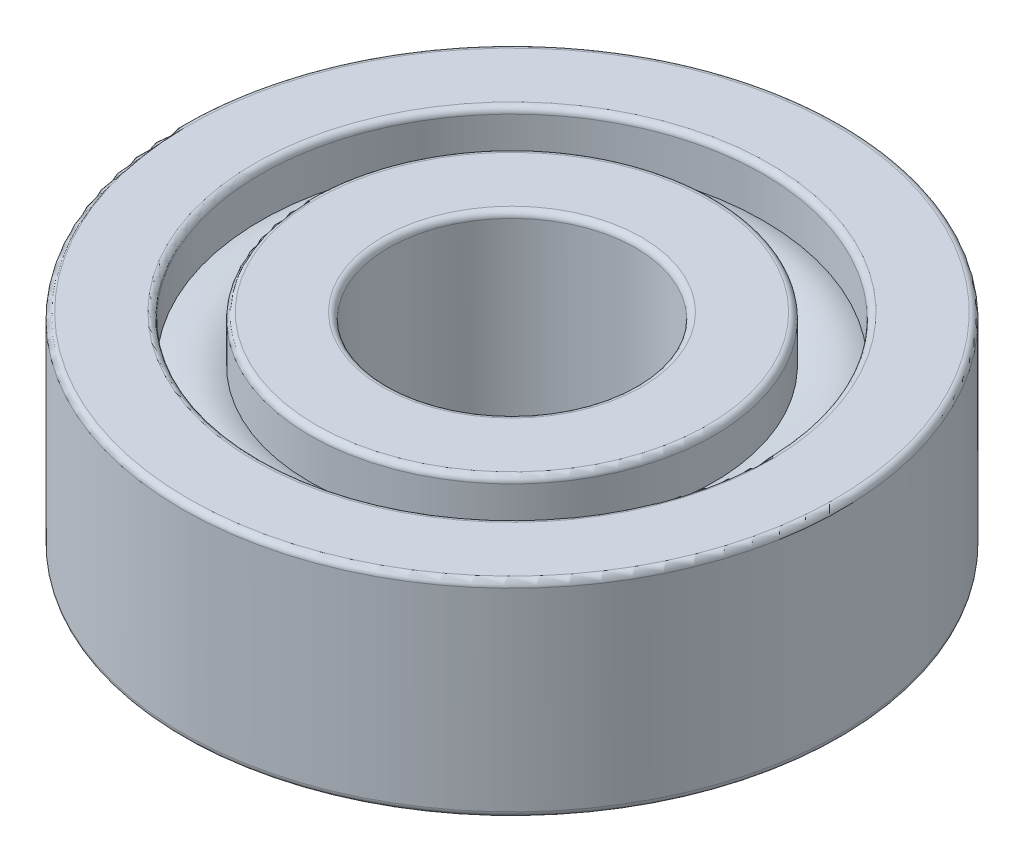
ISO-10303-21;
HEADER;
FILE_DESCRIPTION(('STEP AP214'),'2;1');
FILE_NAME('part.step','',(''),(''),'','','');
FILE_SCHEMA(('AUTOMOTIVE_DESIGN { 1 0 10303 214 1 1 1 1 }'));
ENDSEC;
DATA;
#1=APPLICATION_CONTEXT('core data for automotive mechanical design processes');
#2=APPLICATION_PROTOCOL_DEFINITION('international standard','automotive_design',2000,#1);
#3=PRODUCT_CONTEXT('',#1,'mechanical');
#4=PRODUCT('Part','Part','',(#3));
#5=PRODUCT_RELATED_PRODUCT_CATEGORY('part','',(#4));
#6=PRODUCT_DEFINITION_FORMATION('','',#4);
#7=PRODUCT_DEFINITION_CONTEXT('part definition',#1,'design');
#8=PRODUCT_DEFINITION('design','',#6,#7);
#9=PRODUCT_DEFINITION_SHAPE('','',#8);
#10=(LENGTH_UNIT() NAMED_UNIT(*) SI_UNIT(.MILLI.,.METRE.));
#11=(NAMED_UNIT(*) PLANE_ANGLE_UNIT() SI_UNIT($,.RADIAN.));
#12=(NAMED_UNIT(*) SI_UNIT($,.STERADIAN.) SOLID_ANGLE_UNIT());
#13=UNCERTAINTY_MEASURE_WITH_UNIT(LENGTH_MEASURE(1.E-05),#10,'distance_accuracy_value','');
#14=(GEOMETRIC_REPRESENTATION_CONTEXT(3) GLOBAL_UNCERTAINTY_ASSIGNED_CONTEXT((#13)) GLOBAL_UNIT_ASSIGNED_CONTEXT((#10,
#11,#12)) REPRESENTATION_CONTEXT('',''));
#15=CARTESIAN_POINT('',(0.,0.,0.));
#16=DIRECTION('',(0.,0.,1.));
#17=DIRECTION('',(1.,0.,0.));
#18=AXIS2_PLACEMENT_3D('',#15,#16,#17);
#19=CARTESIAN_POINT('',(1.38777878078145E-13,0.,1.38777878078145E-13));
#20=DIRECTION('',(0.,-1.,0.));
#21=DIRECTION('',(0.,0.,-1.));
#22=AXIS2_PLACEMENT_3D('',#19,#20,#21);
#23=CYLINDRICAL_SURFACE('',#22,6.);
#24=CARTESIAN_POINT('',(0.,0.300000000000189,1.2490009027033E-13));
#25=DIRECTION('',(0.,-1.,0.));
#26=DIRECTION('',(0.,0.,-1.));
#27=AXIS2_PLACEMENT_3D('',#24,#25,#26);
#28=CIRCLE('',#27,6.);
#29=CARTESIAN_POINT('',(0.,0.300000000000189,-5.99999999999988));
#30=VERTEX_POINT('',#29);
#31=EDGE_CURVE('E91',#30,#30,#28,.T.);
#32=ORIENTED_EDGE('',*,*,#31,.T.);
#33=EDGE_LOOP('',(#32));
#34=FACE_BOUND('',#33,.T.);
#35=CARTESIAN_POINT('',(1.38777878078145E-13,9.70000000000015,-5.41233724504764E-13));
#36=DIRECTION('',(0.,1.,0.));
#37=DIRECTION('',(0.,0.,1.));
#38=AXIS2_PLACEMENT_3D('',#35,#36,#37);
#39=CIRCLE('',#38,6.);
#40=CARTESIAN_POINT('',(1.65256697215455E-13,9.70000000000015,5.99999999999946));
#41=VERTEX_POINT('',#40);
#42=EDGE_CURVE('E94',#41,#41,#39,.T.);
#43=ORIENTED_EDGE('',*,*,#42,.T.);
#44=EDGE_LOOP('',(#43));
#45=FACE_BOUND('',#44,.T.);
#46=ADVANCED_FACE('F42',(#34,#45),#23,.F.);
#47=CARTESIAN_POINT('',(6.00000000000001,0.,0.));
#48=DIRECTION('',(0.,-1.,0.));
#49=DIRECTION('',(0.,0.,-1.));
#50=AXIS2_PLACEMENT_3D('',#47,#48,#49);
#51=PLANE('',#50);
#52=CARTESIAN_POINT('',(1.38777878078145E-13,0.,1.38777878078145E-13));
#53=DIRECTION('',(0.,-1.,0.));
#54=DIRECTION('',(0.,0.,-1.));
#55=AXIS2_PLACEMENT_3D('',#52,#53,#54);
#56=CIRCLE('',#55,6.3);
#57=CARTESIAN_POINT('',(1.10975117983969E-13,0.,-6.29999999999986));
#58=VERTEX_POINT('',#57);
#59=EDGE_CURVE('E85',#58,#58,#56,.F.);
#60=ORIENTED_EDGE('',*,*,#59,.T.);
#61=EDGE_LOOP('',(#60));
#62=FACE_BOUND('',#61,.T.);
#63=CARTESIAN_POINT('',(1.38777878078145E-13,0.,1.38777878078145E-13));
#64=DIRECTION('',(0.,-1.,0.));
#65=DIRECTION('',(0.,0.,-1.));
#66=AXIS2_PLACEMENT_3D('',#63,#64,#65);
#67=CIRCLE('',#66,9.5);
#68=CARTESIAN_POINT('',(0.,0.,-9.49999999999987));
#69=VERTEX_POINT('',#68);
#70=EDGE_CURVE('E88',#69,#69,#67,.T.);
#71=ORIENTED_EDGE('',*,*,#70,.T.);
#72=EDGE_LOOP('',(#71));
#73=FACE_BOUND('',#72,.T.);
#74=ADVANCED_FACE('F128',(#62,#73),#51,.T.);
#75=CARTESIAN_POINT('',(1.38777878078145E-13,0.,1.38777878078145E-13));
#76=DIRECTION('',(0.,-1.,0.));
#77=DIRECTION('',(0.,0.,-1.));
#78=AXIS2_PLACEMENT_3D('',#75,#76,#77);
#79=CYLINDRICAL_SURFACE('',#78,9.8);
#80=CARTESIAN_POINT('',(0.,0.300000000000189,1.2490009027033E-13));
#81=DIRECTION('',(0.,-1.,0.));
#82=DIRECTION('',(0.,0.,-1.));
#83=AXIS2_PLACEMENT_3D('',#80,#81,#82);
#84=CIRCLE('',#83,9.8);
#85=CARTESIAN_POINT('',(0.,0.30000000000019,-9.79999999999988));
#86=VERTEX_POINT('',#85);
#87=EDGE_CURVE('E82',#86,#86,#84,.F.);
#88=ORIENTED_EDGE('',*,*,#87,.T.);
#89=EDGE_LOOP('',(#88));
#90=FACE_BOUND('',#89,.T.);
#91=CARTESIAN_POINT('',(1.11022302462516E-13,2.25045458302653,1.66533453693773E-13));
#92=DIRECTION('',(0.,-1.,0.));
#93=DIRECTION('',(0.,0.,-1.));
#94=AXIS2_PLACEMENT_3D('',#91,#92,#93);
#95=CIRCLE('',#94,9.8);
#96=CARTESIAN_POINT('',(0.,2.25045458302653,-9.79999999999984));
#97=VERTEX_POINT('',#96);
#98=EDGE_CURVE('E97',#97,#97,#95,.T.);
#99=ORIENTED_EDGE('',*,*,#98,.T.);
#100=EDGE_LOOP('',(#99));
#101=FACE_BOUND('',#100,.T.);
#102=ADVANCED_FACE('F133',(#90,#101),#79,.T.);
#103=CARTESIAN_POINT('',(0.,5.00000000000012,0.));
#104=DIRECTION('',(0.,-1.,0.));
#105=DIRECTION('',(0.,0.,-1.));
#106=AXIS2_PLACEMENT_3D('',#103,#104,#105);
#107=TOROIDAL_SURFACE('',#106,11.,3.);
#108=CARTESIAN_POINT('',(1.11022302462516E-13,2.25045458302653,1.66533453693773E-13));
#109=DIRECTION('',(0.,-1.,0.));
#110=DIRECTION('',(0.,0.,-1.));
#111=AXIS2_PLACEMENT_3D('',#108,#109,#110);
#112=CIRCLE('',#111,12.2);
#113=CARTESIAN_POINT('',(0.,2.25045458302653,-12.1999999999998));
#114=VERTEX_POINT('',#113);
#115=EDGE_CURVE('E100',#114,#114,#112,.T.);
#116=ORIENTED_EDGE('',*,*,#115,.T.);
#117=EDGE_LOOP('',(#116));
#118=FACE_BOUND('',#117,.T.);
#119=ORIENTED_EDGE('',*,*,#98,.F.);
#120=EDGE_LOOP('',(#119));
#121=FACE_BOUND('',#120,.T.);
#122=ADVANCED_FACE('F241',(#118,#121),#107,.T.);
#123=CARTESIAN_POINT('',(1.38777878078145E-13,0.,1.38777878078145E-13));
#124=DIRECTION('',(0.,-1.,0.));
#125=DIRECTION('',(0.,0.,-1.));
#126=AXIS2_PLACEMENT_3D('',#123,#124,#125);
#127=CYLINDRICAL_SURFACE('',#126,12.2);
#128=CARTESIAN_POINT('',(0.,0.300000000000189,1.2490009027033E-13));
#129=DIRECTION('',(0.,-1.,0.));
#130=DIRECTION('',(0.,0.,-1.));
#131=AXIS2_PLACEMENT_3D('',#128,#129,#130);
#132=CIRCLE('',#131,12.2);
#133=CARTESIAN_POINT('',(0.,0.30000000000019,-12.1999999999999));
#134=VERTEX_POINT('',#133);
#135=EDGE_CURVE('E79',#134,#134,#132,.T.);
#136=ORIENTED_EDGE('',*,*,#135,.T.);
#137=EDGE_LOOP('',(#136));
#138=FACE_BOUND('',#137,.T.);
#139=ORIENTED_EDGE('',*,*,#115,.F.);
#140=EDGE_LOOP('',(#139));
#141=FACE_BOUND('',#140,.T.);
#142=ADVANCED_FACE('F237',(#138,#141),#127,.F.);
#143=CARTESIAN_POINT('',(12.2000000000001,4.44089209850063E-13,0.));
#144=DIRECTION('',(0.,-1.,0.));
#145=DIRECTION('',(0.,0.,-1.));
#146=AXIS2_PLACEMENT_3D('',#143,#144,#145);
#147=PLANE('',#146);
#148=CARTESIAN_POINT('',(1.38777878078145E-13,0.,1.38777878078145E-13));
#149=DIRECTION('',(0.,-1.,0.));
#150=DIRECTION('',(0.,0.,-1.));
#151=AXIS2_PLACEMENT_3D('',#148,#149,#150);
#152=CIRCLE('',#151,12.5);
#153=CARTESIAN_POINT('',(0.,0.,-12.4999999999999));
#154=VERTEX_POINT('',#153);
#155=EDGE_CURVE('E73',#154,#154,#152,.F.);
#156=ORIENTED_EDGE('',*,*,#155,.T.);
#157=EDGE_LOOP('',(#156));
#158=FACE_BOUND('',#157,.T.);
#159=CARTESIAN_POINT('',(1.38777878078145E-13,0.,1.38777878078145E-13));
#160=DIRECTION('',(0.,-1.,0.));
#161=DIRECTION('',(0.,0.,-1.));
#162=AXIS2_PLACEMENT_3D('',#159,#160,#161);
#163=CIRCLE('',#162,15.7);
#164=CARTESIAN_POINT('',(0.,0.,-15.6999999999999));
#165=VERTEX_POINT('',#164);
#166=EDGE_CURVE('E76',#165,#165,#163,.T.);
#167=ORIENTED_EDGE('',*,*,#166,.T.);
#168=EDGE_LOOP('',(#167));
#169=FACE_BOUND('',#168,.T.);
#170=ADVANCED_FACE('F231',(#158,#169),#147,.T.);
#171=CARTESIAN_POINT('',(1.38777878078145E-13,0.,1.38777878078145E-13));
#172=DIRECTION('',(0.,-1.,0.));
#173=DIRECTION('',(0.,0.,-1.));
#174=AXIS2_PLACEMENT_3D('',#171,#172,#173);
#175=CYLINDRICAL_SURFACE('',#174,16.);
#176=CARTESIAN_POINT('',(0.,0.300000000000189,1.2490009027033E-13));
#177=DIRECTION('',(0.,-1.,0.));
#178=DIRECTION('',(0.,0.,-1.));
#179=AXIS2_PLACEMENT_3D('',#176,#177,#178);
#180=CIRCLE('',#179,16.);
#181=CARTESIAN_POINT('',(0.,0.30000000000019,-15.9999999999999));
#182=VERTEX_POINT('',#181);
#183=EDGE_CURVE('E67',#182,#182,#180,.F.);
#184=ORIENTED_EDGE('',*,*,#183,.T.);
#185=EDGE_LOOP('',(#184));
#186=FACE_BOUND('',#185,.T.);
#187=CARTESIAN_POINT('',(1.38777878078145E-13,9.70000000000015,-5.41233724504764E-13));
#188=DIRECTION('',(0.,1.,0.));
#189=DIRECTION('',(0.,0.,1.));
#190=AXIS2_PLACEMENT_3D('',#187,#188,#189);
#191=CIRCLE('',#190,16.);
#192=CARTESIAN_POINT('',(2.09388062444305E-13,9.70000000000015,15.9999999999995));
#193=VERTEX_POINT('',#192);
#194=EDGE_CURVE('E70',#193,#193,#191,.F.);
#195=ORIENTED_EDGE('',*,*,#194,.T.);
#196=EDGE_LOOP('',(#195));
#197=FACE_BOUND('',#196,.T.);
#198=ADVANCED_FACE('F224',(#186,#197),#175,.T.);
#199=CARTESIAN_POINT('',(16.0000000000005,10.,-3.19189119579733E-13));
#200=DIRECTION('',(0.,1.,0.));
#201=DIRECTION('',(0.,0.,1.));
#202=AXIS2_PLACEMENT_3D('',#199,#200,#201);
#203=PLANE('',#202);
#204=CARTESIAN_POINT('',(0.,10.,-5.55111512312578E-13));
#205=DIRECTION('',(0.,1.,0.));
#206=DIRECTION('',(0.,0.,1.));
#207=AXIS2_PLACEMENT_3D('',#204,#205,#206);
#208=CIRCLE('',#207,15.7);
#209=CARTESIAN_POINT('',(1.52552970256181E-13,10.,15.6999999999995));
#210=VERTEX_POINT('',#209);
#211=EDGE_CURVE('E48',#210,#210,#208,.T.);
#212=ORIENTED_EDGE('',*,*,#211,.T.);
#213=EDGE_LOOP('',(#212));
#214=FACE_BOUND('',#213,.T.);
#215=CARTESIAN_POINT('',(0.,10.,-5.55111512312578E-13));
#216=DIRECTION('',(0.,1.,0.));
#217=DIRECTION('',(0.,0.,1.));
#218=AXIS2_PLACEMENT_3D('',#215,#216,#217);
#219=CIRCLE('',#218,12.5);
#220=CARTESIAN_POINT('',(1.38430933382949E-13,10.,12.4999999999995));
#221=VERTEX_POINT('',#220);
#222=EDGE_CURVE('E52',#221,#221,#219,.F.);
#223=ORIENTED_EDGE('',*,*,#222,.T.);
#224=EDGE_LOOP('',(#223));
#225=FACE_BOUND('',#224,.T.);
#226=ADVANCED_FACE('F222',(#214,#225),#203,.T.);
#227=CARTESIAN_POINT('',(1.38777878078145E-13,0.,1.38777878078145E-13));
#228=DIRECTION('',(0.,-1.,0.));
#229=DIRECTION('',(0.,0.,-1.));
#230=AXIS2_PLACEMENT_3D('',#227,#228,#229);
#231=CYLINDRICAL_SURFACE('',#230,12.2);
#232=CARTESIAN_POINT('',(1.38777878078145E-13,9.70000000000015,-5.41233724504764E-13));
#233=DIRECTION('',(0.,1.,0.));
#234=DIRECTION('',(0.,0.,1.));
#235=AXIS2_PLACEMENT_3D('',#232,#233,#234);
#236=CIRCLE('',#235,12.2);
#237=CARTESIAN_POINT('',(1.92618143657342E-13,9.70000000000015,12.1999999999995));
#238=VERTEX_POINT('',#237);
#239=EDGE_CURVE('E10',#238,#238,#236,.T.);
#240=ORIENTED_EDGE('',*,*,#239,.T.);
#241=EDGE_LOOP('',(#240));
#242=FACE_BOUND('',#241,.T.);
#243=CARTESIAN_POINT('',(-1.11022302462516E-13,7.74954541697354,0.));
#244=DIRECTION('',(0.,-1.,0.));
#245=DIRECTION('',(0.,0.,-1.));
#246=AXIS2_PLACEMENT_3D('',#243,#244,#245);
#247=CIRCLE('',#246,12.2);
#248=CARTESIAN_POINT('',(-1.64862568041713E-13,7.74954541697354,-12.2));
#249=VERTEX_POINT('',#248);
#250=EDGE_CURVE('E103',#249,#249,#247,.T.);
#251=ORIENTED_EDGE('',*,*,#250,.T.);
#252=EDGE_LOOP('',(#251));
#253=FACE_BOUND('',#252,.T.);
#254=ADVANCED_FACE('F125',(#242,#253),#231,.F.);
#255=CARTESIAN_POINT('',(0.,5.00000000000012,0.));
#256=DIRECTION('',(0.,-1.,0.));
#257=DIRECTION('',(0.,0.,-1.));
#258=AXIS2_PLACEMENT_3D('',#255,#256,#257);
#259=TOROIDAL_SURFACE('',#258,11.,3.);
#260=CARTESIAN_POINT('',(-1.11022302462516E-13,7.74954541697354,0.));
#261=DIRECTION('',(0.,-1.,0.));
#262=DIRECTION('',(0.,0.,-1.));
#263=AXIS2_PLACEMENT_3D('',#260,#261,#262);
#264=CIRCLE('',#263,9.8);
#265=CARTESIAN_POINT('',(-1.54271040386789E-13,7.74954541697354,-9.8));
#266=VERTEX_POINT('',#265);
#267=EDGE_CURVE('E106',#266,#266,#264,.T.);
#268=ORIENTED_EDGE('',*,*,#267,.T.);
#269=EDGE_LOOP('',(#268));
#270=FACE_BOUND('',#269,.T.);
#271=ORIENTED_EDGE('',*,*,#250,.F.);
#272=EDGE_LOOP('',(#271));
#273=FACE_BOUND('',#272,.T.);
#274=ADVANCED_FACE('F110',(#270,#273),#259,.T.);
#275=CARTESIAN_POINT('',(1.38777878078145E-13,0.,1.38777878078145E-13));
#276=DIRECTION('',(0.,-1.,0.));
#277=DIRECTION('',(0.,0.,-1.));
#278=AXIS2_PLACEMENT_3D('',#275,#276,#277);
#279=CYLINDRICAL_SURFACE('',#278,9.8);
#280=CARTESIAN_POINT('',(1.38777878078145E-13,9.70000000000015,-5.41233724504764E-13));
#281=DIRECTION('',(0.,1.,0.));
#282=DIRECTION('',(0.,0.,1.));
#283=AXIS2_PLACEMENT_3D('',#280,#281,#282);
#284=CIRCLE('',#283,9.8);
#285=CARTESIAN_POINT('',(1.82026616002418E-13,9.70000000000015,9.79999999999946));
#286=VERTEX_POINT('',#285);
#287=EDGE_CURVE('E64',#286,#286,#284,.F.);
#288=ORIENTED_EDGE('',*,*,#287,.T.);
#289=EDGE_LOOP('',(#288));
#290=FACE_BOUND('',#289,.T.);
#291=ORIENTED_EDGE('',*,*,#267,.F.);
#292=EDGE_LOOP('',(#291));
#293=FACE_BOUND('',#292,.T.);
#294=ADVANCED_FACE('F113',(#290,#293),#279,.T.);
#295=CARTESIAN_POINT('',(9.80000000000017,10.,0.));
#296=DIRECTION('',(0.,1.,0.));
#297=DIRECTION('',(0.,0.,1.));
#298=AXIS2_PLACEMENT_3D('',#295,#296,#297);
#299=PLANE('',#298);
#300=CARTESIAN_POINT('',(0.,10.,-5.55111512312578E-13));
#301=DIRECTION('',(0.,1.,0.));
#302=DIRECTION('',(0.,0.,1.));
#303=AXIS2_PLACEMENT_3D('',#300,#301,#302);
#304=CIRCLE('',#303,9.5);
#305=CARTESIAN_POINT('',(1.25191523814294E-13,10.,9.49999999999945));
#306=VERTEX_POINT('',#305);
#307=EDGE_CURVE('E56',#306,#306,#304,.T.);
#308=ORIENTED_EDGE('',*,*,#307,.T.);
#309=EDGE_LOOP('',(#308));
#310=FACE_BOUND('',#309,.T.);
#311=CARTESIAN_POINT('',(0.,10.,-5.55111512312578E-13));
#312=DIRECTION('',(0.,1.,0.));
#313=DIRECTION('',(0.,0.,1.));
#314=AXIS2_PLACEMENT_3D('',#311,#312,#313);
#315=CIRCLE('',#314,6.3);
#316=CARTESIAN_POINT('',(1.11069486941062E-13,10.,6.29999999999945));
#317=VERTEX_POINT('',#316);
#318=EDGE_CURVE('E61',#317,#317,#315,.F.);
#319=ORIENTED_EDGE('',*,*,#318,.T.);
#320=EDGE_LOOP('',(#319));
#321=FACE_BOUND('',#320,.T.);
#322=ADVANCED_FACE('F115',(#310,#321),#299,.T.);
#323=CARTESIAN_POINT('',(0.,0.300000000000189,1.2490009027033E-13));
#324=DIRECTION('',(0.,-1.,0.));
#325=DIRECTION('',(0.,0.,-1.));
#326=AXIS2_PLACEMENT_3D('',#323,#324,#325);
#327=TOROIDAL_SURFACE('',#326,6.3,0.3);
#328=ORIENTED_EDGE('',*,*,#59,.F.);
#329=EDGE_LOOP('',(#328));
#330=FACE_BOUND('',#329,.T.);
#331=ORIENTED_EDGE('',*,*,#31,.F.);
#332=EDGE_LOOP('',(#331));
#333=FACE_BOUND('',#332,.T.);
#334=ADVANCED_FACE('F122',(#330,#333),#327,.T.);
#335=CARTESIAN_POINT('',(0.,0.300000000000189,1.2490009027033E-13));
#336=DIRECTION('',(0.,-1.,0.));
#337=DIRECTION('',(0.,0.,-1.));
#338=AXIS2_PLACEMENT_3D('',#335,#336,#337);
#339=TOROIDAL_SURFACE('',#338,9.5,0.3);
#340=ORIENTED_EDGE('',*,*,#87,.F.);
#341=EDGE_LOOP('',(#340));
#342=FACE_BOUND('',#341,.T.);
#343=ORIENTED_EDGE('',*,*,#70,.F.);
#344=EDGE_LOOP('',(#343));
#345=FACE_BOUND('',#344,.T.);
#346=ADVANCED_FACE('F165',(#342,#345),#339,.T.);
#347=CARTESIAN_POINT('',(0.,0.300000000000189,1.2490009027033E-13));
#348=DIRECTION('',(0.,-1.,0.));
#349=DIRECTION('',(0.,0.,-1.));
#350=AXIS2_PLACEMENT_3D('',#347,#348,#349);
#351=TOROIDAL_SURFACE('',#350,12.5,0.3);
#352=ORIENTED_EDGE('',*,*,#155,.F.);
#353=EDGE_LOOP('',(#352));
#354=FACE_BOUND('',#353,.T.);
#355=ORIENTED_EDGE('',*,*,#135,.F.);
#356=EDGE_LOOP('',(#355));
#357=FACE_BOUND('',#356,.T.);
#358=ADVANCED_FACE('F161',(#354,#357),#351,.T.);
#359=CARTESIAN_POINT('',(0.,0.300000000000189,1.2490009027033E-13));
#360=DIRECTION('',(0.,-1.,0.));
#361=DIRECTION('',(0.,0.,-1.));
#362=AXIS2_PLACEMENT_3D('',#359,#360,#361);
#363=TOROIDAL_SURFACE('',#362,15.7,0.3);
#364=ORIENTED_EDGE('',*,*,#183,.F.);
#365=EDGE_LOOP('',(#364));
#366=FACE_BOUND('',#365,.T.);
#367=ORIENTED_EDGE('',*,*,#166,.F.);
#368=EDGE_LOOP('',(#367));
#369=FACE_BOUND('',#368,.T.);
#370=ADVANCED_FACE('F154',(#366,#369),#363,.T.);
#371=CARTESIAN_POINT('',(1.38777878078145E-13,9.70000000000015,-5.41233724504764E-13));
#372=DIRECTION('',(0.,1.,0.));
#373=DIRECTION('',(0.,0.,1.));
#374=AXIS2_PLACEMENT_3D('',#371,#372,#373);
#375=TOROIDAL_SURFACE('',#374,9.5,0.3);
#376=ORIENTED_EDGE('',*,*,#307,.F.);
#377=EDGE_LOOP('',(#376));
#378=FACE_BOUND('',#377,.T.);
#379=ORIENTED_EDGE('',*,*,#287,.F.);
#380=EDGE_LOOP('',(#379));
#381=FACE_BOUND('',#380,.T.);
#382=ADVANCED_FACE('F143',(#378,#381),#375,.T.);
#383=CARTESIAN_POINT('',(1.38777878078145E-13,9.70000000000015,-5.41233724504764E-13));
#384=DIRECTION('',(0.,1.,0.));
#385=DIRECTION('',(0.,0.,1.));
#386=AXIS2_PLACEMENT_3D('',#383,#384,#385);
#387=TOROIDAL_SURFACE('',#386,6.3,0.3);
#388=ORIENTED_EDGE('',*,*,#42,.F.);
#389=EDGE_LOOP('',(#388));
#390=FACE_BOUND('',#389,.T.);
#391=ORIENTED_EDGE('',*,*,#318,.F.);
#392=EDGE_LOOP('',(#391));
#393=FACE_BOUND('',#392,.T.);
#394=ADVANCED_FACE('F139',(#390,#393),#387,.T.);
#395=CARTESIAN_POINT('',(1.38777878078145E-13,9.70000000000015,-5.41233724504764E-13));
#396=DIRECTION('',(0.,1.,0.));
#397=DIRECTION('',(0.,0.,1.));
#398=AXIS2_PLACEMENT_3D('',#395,#396,#397);
#399=TOROIDAL_SURFACE('',#398,15.7,0.3);
#400=ORIENTED_EDGE('',*,*,#211,.F.);
#401=EDGE_LOOP('',(#400));
#402=FACE_BOUND('',#401,.T.);
#403=ORIENTED_EDGE('',*,*,#194,.F.);
#404=EDGE_LOOP('',(#403));
#405=FACE_BOUND('',#404,.T.);
#406=ADVANCED_FACE('F142',(#402,#405),#399,.T.);
#407=CARTESIAN_POINT('',(1.38777878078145E-13,9.70000000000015,-5.41233724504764E-13));
#408=DIRECTION('',(0.,1.,0.));
#409=DIRECTION('',(0.,0.,1.));
#410=AXIS2_PLACEMENT_3D('',#407,#408,#409);
#411=TOROIDAL_SURFACE('',#410,12.5,0.3);
#412=ORIENTED_EDGE('',*,*,#239,.F.);
#413=EDGE_LOOP('',(#412));
#414=FACE_BOUND('',#413,.T.);
#415=ORIENTED_EDGE('',*,*,#222,.F.);
#416=EDGE_LOOP('',(#415));
#417=FACE_BOUND('',#416,.T.);
#418=ADVANCED_FACE('F151',(#414,#417),#411,.T.);
#419=CLOSED_SHELL('',(#46,#74,#102,#122,#142,#170,#198,#226,#254,#274,#294,#322,#334,#346,#358,
#370,#382,#394,#406,#418));
#420=MANIFOLD_SOLID_BREP('B2',#419);
#421=ADVANCED_BREP_SHAPE_REPRESENTATION('',(#18,#420),#14);
#422=SHAPE_DEFINITION_REPRESENTATION(#9,#421);
ENDSEC;
END-ISO-10303-21;
